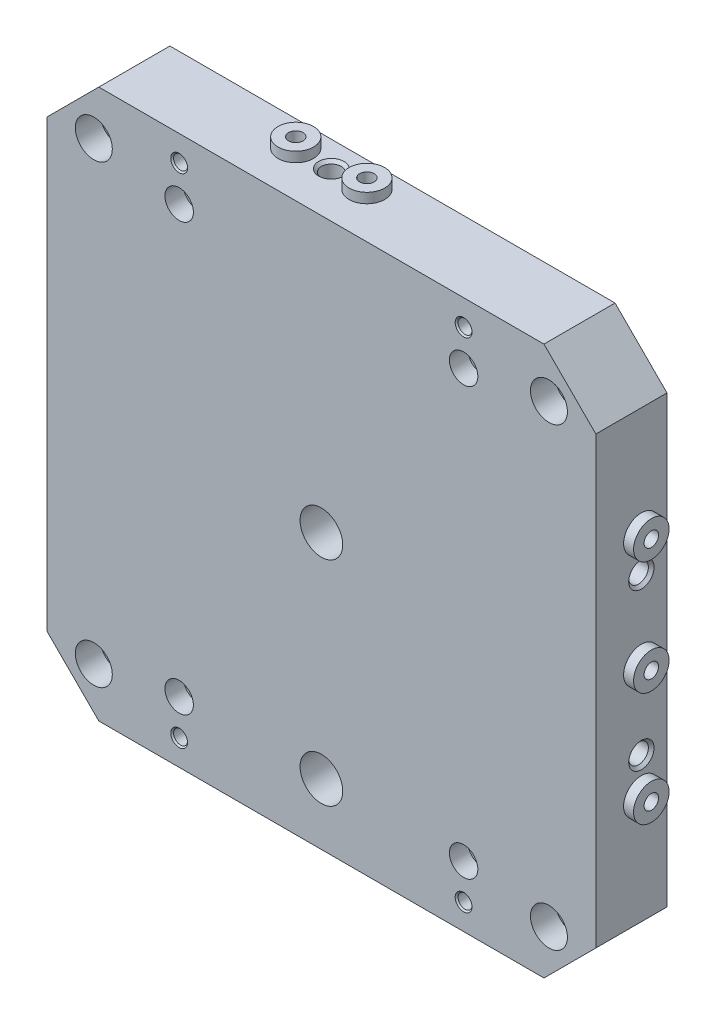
from build123d import *

# Parameters (mm, degrees)
BOSS_EXTRU_1_DEPTH           = 50
ESQUISSE2_R                  = 12.5
BOSS_EXTRU_2_DEPTH           = 7
ESQUISSE3_R                  = 12.5
BOSS_EXTRU_3_DEPTH           = 7
ESQUISSE8_W                  = 15
ESQUISSE8_H                  = 52
ESQUISSE9_W                  = 15
ESQUISSE9_H                  = 52
ESQUISSE21_R                 = 12.5
BOSS_EXTRU_4_DEPTH           = 7
ESQUISSE22_R                 = 12.5
BOSS_EXTRU_5_DEPTH           = 7
ESQUISSE23_R                 = 12.5
BOSS_EXTRU_6_DEPTH           = 7
ENL_V_MAT_EXTRU_1_DEPTH      = 25
ENL_V_MAT_EXTRU_1_DEPTH_BACK = 25
ESQUISSE26_R                 = 5
ENL_V_MAT_EXTRU_2_DEPTH      = 25
ENL_V_MAT_EXTRU_2_DEPTH_BACK = 25
ESQUISSE27_R                 = 5
ENL_V_MAT_EXTRU_3_DEPTH      = 25
ENL_V_MAT_EXTRU_3_DEPTH_BACK = 25
ESQUISSE28_R                 = 5
ENL_V_MAT_EXTRU_4_DEPTH      = 25
ENL_V_MAT_EXTRU_4_DEPTH_BACK = 25
ESQUISSE29_R                 = 5
ENL_V_MAT_EXTRU_5_DEPTH      = 25
ENL_V_MAT_EXTRU_5_DEPTH_BACK = 25
ESQUISSE30_R                 = 5
TROU_TARAUD_M121_D           = 10.2
TROU_TARAUD_M121_DEPTH       = 32.75
TROU_TARAUD_M121_TIP         = 3.064389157
TROU_TARAUD_M122_D           = 10.2
TROU_TARAUD_M122_DEPTH       = 32.75
TROU_TARAUD_M122_TIP         = 3.064389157


with BuildPart() as part:
    # Esquisse1 → Boss.-Extru.1 (new body)
    with BuildSketch(Plane.XY):
        Polygon((-193, -156.5), (-156.5, -193), (156.5, -193), (193, -156.5), (193, 156.5), (156.5, 193), (-156.5, 193), (-193, 156.5), align=None)
    extrude(amount=BOSS_EXTRU_1_DEPTH)

    # Esquisse2 → Boss.-Extru.2 (add)
    with BuildSketch(Plane(origin=(0, 193, 0), x_dir=(-1, 0, 0), z_dir=(0, 1, 0))):
        with Locations(Location((0, 18, 0), (0, 0, 270))):
            Circle(ESQUISSE2_R)
    extrude(amount=BOSS_EXTRU_2_DEPTH)

    # Esquisse3 → Boss.-Extru.3 (add)
    with BuildSketch(Plane(origin=(0, 193, 0), x_dir=(-1, 0, 0), z_dir=(0, 1, 0))):
        with Locations(Location((50, 18, 0), (0, 0, 270))):
            Circle(ESQUISSE3_R)
    extrude(amount=BOSS_EXTRU_3_DEPTH)

    # Esquisse4 → Enl_vement de mati_re-R_volution1 (revolve, cut)
    with BuildSketch(Plane(origin=(0, 160, 0), x_dir=(-1, 0, 0), z_dir=(0, 1, 0))):
        Polygon((160, -1), (151.25, -1), (151.25, 32.5), (147, 32.5), (147, 51), (160, 51), align=None)
    revolve(axis=Axis((-160, 160, 51), (0, 0, -1)), mode=Mode.SUBTRACT)

    # Esquisse5 → Enl_vement de mati_re-R_volution2 (revolve, cut)
    with BuildSketch(Plane(origin=(0, 160, 0), x_dir=(-1, 0, 0), z_dir=(0, 1, 0))):
        Polygon((-160, -1), (-168.75, -1), (-168.75, 32.5), (-173, 32.5), (-173, 51), (-160, 51), align=None)
    revolve(axis=Axis((160, 160, 51), (0, 0, -1)), mode=Mode.SUBTRACT)

    # Esquisse6 → Enl_vement de mati_re-R_volution3 (revolve, cut)
    with BuildSketch(Plane(origin=(0, -160, 0), x_dir=(-1, 0, 0), z_dir=(0, 1, 0))):
        Polygon((-160, -1), (-168.75, -1), (-168.75, 32.5), (-173, 32.5), (-173, 51), (-160, 51), align=None)
    revolve(axis=Axis((160, -160, 51), (0, 0, -1)), mode=Mode.SUBTRACT)

    # Esquisse7 → Enl_vement de mati_re-R_volution4 (revolve, cut)
    with BuildSketch(Plane(origin=(0, -160, 0), x_dir=(-1, 0, 0), z_dir=(0, 1, 0))):
        Polygon((160, -1), (151.25, -1), (151.25, 32.5), (147, 32.5), (147, 51), (160, 51), align=None)
    revolve(axis=Axis((-160, -160, 51), (0, 0, -1)), mode=Mode.SUBTRACT)

    # Esquisse8 → Enl_vement de mati_re-R_volution5 (revolve, cut)
    with BuildSketch(Plane(origin=(0, 0, 0), x_dir=(1, 0, 0), z_dir=(0, 1, 0))):
        with Locations((7.5, -25)):
            Rectangle(ESQUISSE8_W, ESQUISSE8_H)
    revolve(axis=Axis((0, 0, 51), (0, 0, -1)), mode=Mode.SUBTRACT)

    # Esquisse9 → Enl_vement de mati_re-R_volution6 (revolve, cut)
    with BuildSketch(Plane(origin=(0, -150, 0), x_dir=(-1, 0, 0), z_dir=(0, 1, 0))):
        with Locations((-7.5, 25)):
            Rectangle(ESQUISSE9_W, ESQUISSE9_H)
    revolve(axis=Axis((0, -150, 51), (0, 0, -1)), mode=Mode.SUBTRACT)

    # Esquisse10 → Enl_vement de mati_re-R_volution7 (revolve, cut)
    with BuildSketch(Plane(origin=(0, 150, 0), x_dir=(-1, 0, 0), z_dir=(0, 1, 0))):
        Polygon((-100, 51), (-90, 51), (-90, 37), (-93.25, 37), (-93.25, -1), (-100, -1), align=None)
    revolve(axis=Axis((100, 150, -1), (0, 0, 1)), mode=Mode.SUBTRACT)

    # Esquisse11 → Enl_vement de mati_re-R_volution8 (revolve, cut)
    with BuildSketch(Plane(origin=(0, 150, 0), x_dir=(-1, 0, 0), z_dir=(0, 1, 0))):
        Polygon((100, 51), (110, 51), (110, 37), (106.75, 37), (106.75, -1), (100, -1), align=None)
    revolve(axis=Axis((-100, 150, -1), (0, 0, 1)), mode=Mode.SUBTRACT)

    # Esquisse12 → Enl_vement de mati_re-R_volution9 (revolve, cut)
    with BuildSketch(Plane(origin=(0, -150, 0), x_dir=(-1, 0, 0), z_dir=(0, 1, 0))):
        Polygon((-100, 51), (-90, 51), (-90, 37), (-93.25, 37), (-93.25, -1), (-100, -1), align=None)
    revolve(axis=Axis((100, -150, -1), (0, 0, 1)), mode=Mode.SUBTRACT)

    # Esquisse13 → Enl_vement de mati_re-R_volution10 (revolve, cut)
    with BuildSketch(Plane(origin=(0, -150, 0), x_dir=(-1, 0, 0), z_dir=(0, 1, 0))):
        Polygon((100, 51), (110, 51), (110, 37), (106.75, 37), (106.75, -1), (100, -1), align=None)
    revolve(axis=Axis((-100, -150, -1), (0, 0, 1)), mode=Mode.SUBTRACT)

    # Esquisse14 → Enl_vement de mati_re-R_volution11 (revolve, cut)
    with BuildSketch(Plane(origin=(0, 175, 0), x_dir=(-1, 0, 0), z_dir=(0, 1, 0))):
        Polygon((100, -2), (92.083, -2), (95.083, 1), (95.083, 49), (92.083, 52), (100, 52), align=None)
    revolve(axis=Axis((-100, 175, 52), (0, 0, -1)), mode=Mode.SUBTRACT)

    # Esquisse15 → Enl_vement de mati_re-R_volution12 (revolve, cut)
    with BuildSketch(Plane(origin=(0, 175, 0), x_dir=(-1, 0, 0), z_dir=(0, 1, 0))):
        Polygon((-100, -2), (-107.917, -2), (-104.917, 1), (-104.917, 49), (-107.917, 52), (-100, 52), align=None)
    revolve(axis=Axis((100, 175, 52), (0, 0, -1)), mode=Mode.SUBTRACT)

    # Esquisse16 → Enl_vement de mati_re-R_volution13 (revolve, cut)
    with BuildSketch(Plane(origin=(0, -175, 0), x_dir=(-1, 0, 0), z_dir=(0, 1, 0))):
        Polygon((100, -2), (92.083, -2), (95.083, 1), (95.083, 49), (92.083, 52), (100, 52), align=None)
    revolve(axis=Axis((-100, -175, 52), (0, 0, -1)), mode=Mode.SUBTRACT)

    # Esquisse17 → Enl_vement de mati_re-R_volution14 (revolve, cut)
    with BuildSketch(Plane(origin=(0, -175, 0), x_dir=(-1, 0, 0), z_dir=(0, 1, 0))):
        Polygon((-100, -2), (-107.917, -2), (-104.917, 1), (-104.917, 49), (-107.917, 52), (-100, 52), align=None)
    revolve(axis=Axis((100, -175, 52), (0, 0, -1)), mode=Mode.SUBTRACT)

    # Esquisse20 → Enl_vement de mati_re-R_volution17 (revolve, cut)
    with BuildSketch(Plane(origin=(-25, 0, 0), x_dir=(0, 0, -1), z_dir=(1, 0, 0))):
        Polygon((-18, 194), (-8.0825, 194), (-11.0825, 191), (-11.0825, 127.993820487), (-18, 124), align=None)
    revolve(axis=Axis((-25, 124, 18), (0, 1, 0)), mode=Mode.SUBTRACT)

    # Esquisse21 → Boss.-Extru.4 (add)
    with BuildSketch(Plane(origin=(193, 0, 0), x_dir=(0, 0, -1), z_dir=(1, 0, 0))):
        with Locations(Location((-18, 0, 0), (0, 0, 180))):
            Circle(ESQUISSE21_R)
    extrude(amount=BOSS_EXTRU_4_DEPTH)

    # Esquisse22 → Boss.-Extru.5 (add)
    with BuildSketch(Plane(origin=(193, 0, 0), x_dir=(0, 0, -1), z_dir=(1, 0, 0))):
        with Locations(Location((-18, 80, 0), (0, 0, 180))):
            Circle(ESQUISSE22_R)
    extrude(amount=BOSS_EXTRU_5_DEPTH)

    # Esquisse23 → Boss.-Extru.6 (add)
    with BuildSketch(Plane(origin=(193, 0, 0), x_dir=(0, 0, -1), z_dir=(1, 0, 0))):
        with Locations(Location((-18, -80, 0), (0, 0, 180))):
            Circle(ESQUISSE23_R)
    extrude(amount=BOSS_EXTRU_6_DEPTH)

    # Esquisse24 → Enl_vement de mati_re-R_volution18 (revolve, cut)
    with BuildSketch(Plane(origin=(0, 55, 0), x_dir=(-1, 0, 0), z_dir=(0, 1, 0))):
        Polygon((-194, 18), (-194, 27.9175), (-191, 24.9175), (-127.993820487, 24.9175), (-124, 18), align=None)
    revolve(axis=Axis((124, 55, 18), (1, 0, 0)), mode=Mode.SUBTRACT)

    # Esquisse25 → Enl_vement de mati_re-R_volution19 (revolve, cut)
    with BuildSketch(Plane(origin=(0, -55, 0), x_dir=(-1, 0, 0), z_dir=(0, 1, 0))):
        Polygon((-194, 18), (-194, 27.9175), (-191, 24.9175), (-127.993820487, 24.9175), (-124, 18), align=None)
    revolve(axis=Axis((124, -55, 18), (1, 0, 0)), mode=Mode.SUBTRACT)

    # Esquisse26 → Enl_v. mat.-Extru.1 (cut, two sides: drawn at the far end of the back side and taken through both)
    with BuildSketch(Plane(origin=(0, 200, 0), x_dir=(-1, 0, 0), z_dir=(0, 1, 0)).offset(-ENL_V_MAT_EXTRU_1_DEPTH_BACK)):
        with Locations(Location((0, 18, 0), (0, 0, 90))):
            Circle(ESQUISSE26_R)
    extrude(amount=ENL_V_MAT_EXTRU_1_DEPTH + ENL_V_MAT_EXTRU_1_DEPTH_BACK, mode=Mode.SUBTRACT)

    # Esquisse27 → Enl_v. mat.-Extru.2 (cut, two sides: drawn at the far end of the back side and taken through both)
    with BuildSketch(Plane(origin=(0, 200, 0), x_dir=(-1, 0, 0), z_dir=(0, 1, 0)).offset(-ENL_V_MAT_EXTRU_2_DEPTH_BACK)):
        with Locations(Location((50, 18, 0), (0, 0, 90))):
            Circle(ESQUISSE27_R)
    extrude(amount=ENL_V_MAT_EXTRU_2_DEPTH + ENL_V_MAT_EXTRU_2_DEPTH_BACK, mode=Mode.SUBTRACT)

    # Esquisse28 → Enl_v. mat.-Extru.3 (cut, two sides: drawn at the far end of the back side and taken through both)
    with BuildSketch(Plane(origin=(200, 0, 0), x_dir=(0, 0, -1), z_dir=(1, 0, 0)).offset(-ENL_V_MAT_EXTRU_3_DEPTH_BACK)):
        with Locations((-18, 80)):
            Circle(ESQUISSE28_R)
    extrude(amount=ENL_V_MAT_EXTRU_3_DEPTH + ENL_V_MAT_EXTRU_3_DEPTH_BACK, mode=Mode.SUBTRACT)

    # Esquisse29 → Enl_v. mat.-Extru.4 (cut, two sides: drawn at the far end of the back side and taken through both)
    with BuildSketch(Plane(origin=(200, 0, 0), x_dir=(0, 0, -1), z_dir=(1, 0, 0)).offset(-ENL_V_MAT_EXTRU_4_DEPTH_BACK)):
        with Locations((-18, 0)):
            Circle(ESQUISSE29_R)
    extrude(amount=ENL_V_MAT_EXTRU_4_DEPTH + ENL_V_MAT_EXTRU_4_DEPTH_BACK, mode=Mode.SUBTRACT)

    # Esquisse30 → Enl_v. mat.-Extru.5 (cut, two sides: drawn at the far end of the back side and taken through both)
    with BuildSketch(Plane(origin=(200, 0, 0), x_dir=(0, 0, -1), z_dir=(1, 0, 0)).offset(-ENL_V_MAT_EXTRU_5_DEPTH_BACK)):
        with Locations((-18, -80)):
            Circle(ESQUISSE30_R)
    extrude(amount=ENL_V_MAT_EXTRU_5_DEPTH + ENL_V_MAT_EXTRU_5_DEPTH_BACK, mode=Mode.SUBTRACT)

    # Trou taraud_ M121
    with Locations(Plane(origin=(200, 0, 0), x_dir=(0, 0, -1), z_dir=(1, 0, 0))):
        with Locations((-18, 80), (-18, 0), (-18, -80)):
            Hole(TROU_TARAUD_M121_D / 2, depth=TROU_TARAUD_M121_DEPTH)
            with Locations((0, 0, -(TROU_TARAUD_M121_DEPTH + TROU_TARAUD_M121_TIP / 2))):  # 118° drill point
                Cone(0, TROU_TARAUD_M121_D / 2, TROU_TARAUD_M121_TIP, mode=Mode.SUBTRACT)

    # Trou taraud_ M122
    with Locations(Plane(origin=(0, 200, 0), x_dir=(-1, 0, 0), z_dir=(0, 1, 0))):
        with Locations((0, 18), (50, 18)):
            Hole(TROU_TARAUD_M122_D / 2, depth=TROU_TARAUD_M122_DEPTH)
            with Locations((0, 0, -(TROU_TARAUD_M122_DEPTH + TROU_TARAUD_M122_TIP / 2))):  # 118° drill point
                Cone(0, TROU_TARAUD_M122_D / 2, TROU_TARAUD_M122_TIP, mode=Mode.SUBTRACT)


solid = part.part
